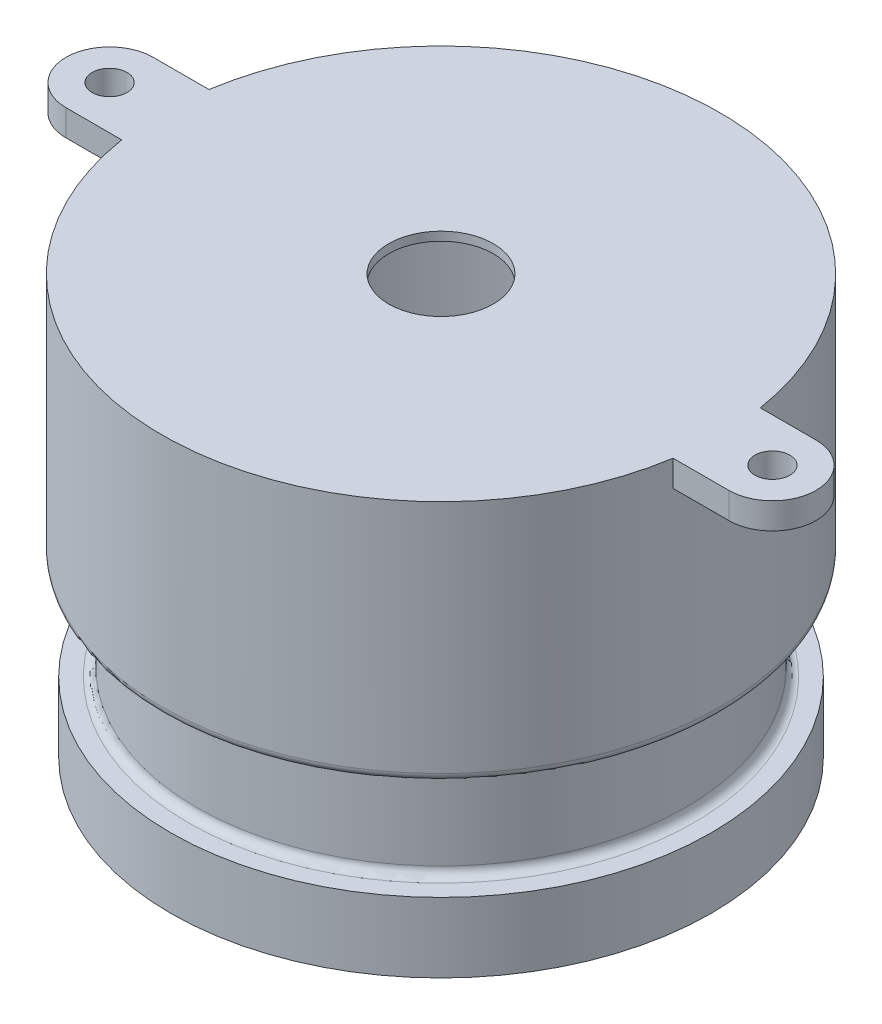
ISO-10303-21;
HEADER;
FILE_DESCRIPTION(('STEP AP214'),'2;1');
FILE_NAME('part.step','',(''),(''),'','','');
FILE_SCHEMA(('AUTOMOTIVE_DESIGN { 1 0 10303 214 1 1 1 1 }'));
ENDSEC;
DATA;
#1=APPLICATION_CONTEXT('core data for automotive mechanical design processes');
#2=APPLICATION_PROTOCOL_DEFINITION('international standard','automotive_design',2000,#1);
#3=PRODUCT_CONTEXT('',#1,'mechanical');
#4=PRODUCT('Part','Part','',(#3));
#5=PRODUCT_RELATED_PRODUCT_CATEGORY('part','',(#4));
#6=PRODUCT_DEFINITION_FORMATION('','',#4);
#7=PRODUCT_DEFINITION_CONTEXT('part definition',#1,'design');
#8=PRODUCT_DEFINITION('design','',#6,#7);
#9=PRODUCT_DEFINITION_SHAPE('','',#8);
#10=(LENGTH_UNIT() NAMED_UNIT(*) SI_UNIT(.MILLI.,.METRE.));
#11=(NAMED_UNIT(*) PLANE_ANGLE_UNIT() SI_UNIT($,.RADIAN.));
#12=(NAMED_UNIT(*) SI_UNIT($,.STERADIAN.) SOLID_ANGLE_UNIT());
#13=UNCERTAINTY_MEASURE_WITH_UNIT(LENGTH_MEASURE(1.E-05),#10,'distance_accuracy_value','');
#14=(GEOMETRIC_REPRESENTATION_CONTEXT(3) GLOBAL_UNCERTAINTY_ASSIGNED_CONTEXT((#13)) GLOBAL_UNIT_ASSIGNED_CONTEXT((#10,
#11,#12)) REPRESENTATION_CONTEXT('',''));
#15=CARTESIAN_POINT('',(0.,0.,0.));
#16=DIRECTION('',(0.,0.,1.));
#17=DIRECTION('',(1.,0.,0.));
#18=AXIS2_PLACEMENT_3D('',#15,#16,#17);
#19=CARTESIAN_POINT('',(-49.2125,-76.2,0.));
#20=DIRECTION('',(0.,1.,0.));
#21=DIRECTION('',(0.,0.,1.));
#22=AXIS2_PLACEMENT_3D('',#19,#20,#21);
#23=PLANE('',#22);
#24=CARTESIAN_POINT('',(0.,-76.2,0.));
#25=DIRECTION('',(0.,-1.,0.));
#26=DIRECTION('',(0.,0.,-1.));
#27=AXIS2_PLACEMENT_3D('',#24,#25,#26);
#28=CIRCLE('',#27,49.2125);
#29=CARTESIAN_POINT('',(0.,-76.2,-49.2125));
#30=VERTEX_POINT('',#29);
#31=EDGE_CURVE('E197',#30,#30,#28,.T.);
#32=ORIENTED_EDGE('',*,*,#31,.T.);
#33=EDGE_LOOP('',(#32));
#34=FACE_BOUND('',#33,.T.);
#35=CARTESIAN_POINT('',(0.,-76.2,0.));
#36=DIRECTION('',(0.,1.,0.));
#37=DIRECTION('',(0.,0.,1.));
#38=AXIS2_PLACEMENT_3D('',#35,#36,#37);
#39=CIRCLE('',#38,47.625);
#40=CARTESIAN_POINT('',(0.,-76.2,47.625));
#41=VERTEX_POINT('',#40);
#42=EDGE_CURVE('E185',#41,#41,#39,.F.);
#43=ORIENTED_EDGE('',*,*,#42,.F.);
#44=EDGE_LOOP('',(#43));
#45=FACE_BOUND('',#44,.T.);
#46=ADVANCED_FACE('F29',(#34,#45),#23,.F.);
#47=CARTESIAN_POINT('',(0.,0.,0.));
#48=DIRECTION('',(0.,-1.,0.));
#49=DIRECTION('',(0.,0.,-1.));
#50=AXIS2_PLACEMENT_3D('',#47,#48,#49);
#51=CYLINDRICAL_SURFACE('',#50,49.2125);
#52=ORIENTED_EDGE('',*,*,#31,.F.);
#53=EDGE_LOOP('',(#52));
#54=FACE_BOUND('',#53,.T.);
#55=CARTESIAN_POINT('',(0.,-63.5,0.));
#56=DIRECTION('',(0.,-1.,0.));
#57=DIRECTION('',(0.,0.,-1.));
#58=AXIS2_PLACEMENT_3D('',#55,#56,#57);
#59=CIRCLE('',#58,49.2125);
#60=CARTESIAN_POINT('',(0.,-63.5,-49.2125));
#61=VERTEX_POINT('',#60);
#62=EDGE_CURVE('E194',#61,#61,#59,.T.);
#63=ORIENTED_EDGE('',*,*,#62,.T.);
#64=EDGE_LOOP('',(#63));
#65=FACE_BOUND('',#64,.T.);
#66=ADVANCED_FACE('F243',(#54,#65),#51,.T.);
#67=CARTESIAN_POINT('',(-44.45,-63.5,0.));
#68=DIRECTION('',(0.,-1.,0.));
#69=DIRECTION('',(0.,0.,-1.));
#70=AXIS2_PLACEMENT_3D('',#67,#68,#69);
#71=PLANE('',#70);
#72=CARTESIAN_POINT('',(0.,-63.5,0.));
#73=DIRECTION('',(0.,-1.,0.));
#74=DIRECTION('',(0.,0.,-1.));
#75=AXIS2_PLACEMENT_3D('',#72,#73,#74);
#76=CIRCLE('',#75,46.0375);
#77=CARTESIAN_POINT('',(0.,-63.5,-46.0375));
#78=VERTEX_POINT('',#77);
#79=EDGE_CURVE('E215',#78,#78,#76,.T.);
#80=ORIENTED_EDGE('',*,*,#79,.T.);
#81=EDGE_LOOP('',(#80));
#82=FACE_BOUND('',#81,.T.);
#83=ORIENTED_EDGE('',*,*,#62,.F.);
#84=EDGE_LOOP('',(#83));
#85=FACE_BOUND('',#84,.T.);
#86=ADVANCED_FACE('F250',(#82,#85),#71,.F.);
#87=CARTESIAN_POINT('',(0.,0.,0.));
#88=DIRECTION('',(0.,-1.,0.));
#89=DIRECTION('',(0.,0.,-1.));
#90=AXIS2_PLACEMENT_3D('',#87,#88,#89);
#91=CYLINDRICAL_SURFACE('',#90,44.45);
#92=CARTESIAN_POINT('',(0.,-46.0375,0.));
#93=DIRECTION('',(0.,1.,0.));
#94=DIRECTION('',(0.,0.,1.));
#95=AXIS2_PLACEMENT_3D('',#92,#93,#94);
#96=CIRCLE('',#95,44.45);
#97=CARTESIAN_POINT('',(0.,-46.0375,44.45));
#98=VERTEX_POINT('',#97);
#99=EDGE_CURVE('E212',#98,#98,#96,.F.);
#100=ORIENTED_EDGE('',*,*,#99,.T.);
#101=EDGE_LOOP('',(#100));
#102=FACE_BOUND('',#101,.T.);
#103=CARTESIAN_POINT('',(0.,-61.9125,0.));
#104=DIRECTION('',(0.,-1.,0.));
#105=DIRECTION('',(0.,0.,-1.));
#106=AXIS2_PLACEMENT_3D('',#103,#104,#105);
#107=CIRCLE('',#106,44.45);
#108=CARTESIAN_POINT('',(0.,-61.9125,-44.45));
#109=VERTEX_POINT('',#108);
#110=EDGE_CURVE('E209',#109,#109,#107,.F.);
#111=ORIENTED_EDGE('',*,*,#110,.T.);
#112=EDGE_LOOP('',(#111));
#113=FACE_BOUND('',#112,.T.);
#114=ADVANCED_FACE('F310',(#102,#113),#91,.T.);
#115=CARTESIAN_POINT('',(-50.8,-44.45,0.));
#116=DIRECTION('',(0.,1.,0.));
#117=DIRECTION('',(0.,0.,1.));
#118=AXIS2_PLACEMENT_3D('',#115,#116,#117);
#119=PLANE('',#118);
#120=CARTESIAN_POINT('',(0.,-44.45,0.));
#121=DIRECTION('',(0.,1.,0.));
#122=DIRECTION('',(0.,0.,1.));
#123=AXIS2_PLACEMENT_3D('',#120,#121,#122);
#124=CIRCLE('',#123,49.2125);
#125=CARTESIAN_POINT('',(0.,-44.45,49.2125));
#126=VERTEX_POINT('',#125);
#127=EDGE_CURVE('E203',#126,#126,#124,.F.);
#128=ORIENTED_EDGE('',*,*,#127,.T.);
#129=EDGE_LOOP('',(#128));
#130=FACE_BOUND('',#129,.T.);
#131=CARTESIAN_POINT('',(0.,-44.45,0.));
#132=DIRECTION('',(0.,1.,0.));
#133=DIRECTION('',(0.,0.,1.));
#134=AXIS2_PLACEMENT_3D('',#131,#132,#133);
#135=CIRCLE('',#134,46.0375);
#136=CARTESIAN_POINT('',(0.,-44.45,46.0375));
#137=VERTEX_POINT('',#136);
#138=EDGE_CURVE('E200',#137,#137,#135,.T.);
#139=ORIENTED_EDGE('',*,*,#138,.T.);
#140=EDGE_LOOP('',(#139));
#141=FACE_BOUND('',#140,.T.);
#142=ADVANCED_FACE('F307',(#130,#141),#119,.F.);
#143=CARTESIAN_POINT('',(0.,0.,0.));
#144=DIRECTION('',(0.,-1.,0.));
#145=DIRECTION('',(0.,0.,-1.));
#146=AXIS2_PLACEMENT_3D('',#143,#144,#145);
#147=CYLINDRICAL_SURFACE('',#146,50.8);
#148=CARTESIAN_POINT('',(0.,-4.7625,0.));
#149=DIRECTION('',(0.,-1.,0.));
#150=DIRECTION('',(0.,0.,-1.));
#151=AXIS2_PLACEMENT_3D('',#148,#149,#150);
#152=CIRCLE('',#151,50.8);
#153=CARTESIAN_POINT('',(50.1760509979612,-4.7625,-7.93750000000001));
#154=VERTEX_POINT('',#153);
#155=CARTESIAN_POINT('',(50.1760509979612,-4.7625,7.93749999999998));
#156=VERTEX_POINT('',#155);
#157=EDGE_CURVE('E44',#154,#156,#152,.T.);
#158=ORIENTED_EDGE('',*,*,#157,.T.);
#159=DIRECTION('',(0.,1.,0.));
#160=VECTOR('',#159,1.);
#161=CARTESIAN_POINT('',(50.1760509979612,-4.7625,7.93749999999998));
#162=LINE('',#161,#160);
#163=CARTESIAN_POINT('',(50.1760509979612,0.,7.93749999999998));
#164=VERTEX_POINT('',#163);
#165=EDGE_CURVE('E132',#156,#164,#162,.T.);
#166=ORIENTED_EDGE('',*,*,#165,.T.);
#167=CARTESIAN_POINT('',(0.,0.,0.));
#168=DIRECTION('',(0.,-1.,0.));
#169=DIRECTION('',(0.,0.,-1.));
#170=AXIS2_PLACEMENT_3D('',#167,#168,#169);
#171=CIRCLE('',#170,50.8);
#172=CARTESIAN_POINT('',(-50.1760509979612,0.,7.9375));
#173=VERTEX_POINT('',#172);
#174=EDGE_CURVE('E174',#164,#173,#171,.T.);
#175=ORIENTED_EDGE('',*,*,#174,.T.);
#176=DIRECTION('',(0.,1.,0.));
#177=VECTOR('',#176,1.);
#178=CARTESIAN_POINT('',(-50.1760509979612,-4.7625,7.9375));
#179=LINE('',#178,#177);
#180=CARTESIAN_POINT('',(-50.1760509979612,-4.7625,7.9375));
#181=VERTEX_POINT('',#180);
#182=EDGE_CURVE('E161',#181,#173,#179,.T.);
#183=ORIENTED_EDGE('',*,*,#182,.F.);
#184=CARTESIAN_POINT('',(0.,-4.7625,0.));
#185=DIRECTION('',(0.,-1.,0.));
#186=DIRECTION('',(0.,0.,1.));
#187=AXIS2_PLACEMENT_3D('',#184,#185,#186);
#188=CIRCLE('',#187,50.8);
#189=CARTESIAN_POINT('',(-50.1760509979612,-4.7625,-7.9375));
#190=VERTEX_POINT('',#189);
#191=EDGE_CURVE('E149',#181,#190,#188,.T.);
#192=ORIENTED_EDGE('',*,*,#191,.T.);
#193=DIRECTION('',(0.,1.,0.));
#194=VECTOR('',#193,1.);
#195=CARTESIAN_POINT('',(-50.1760509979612,-4.7625,-7.9375));
#196=LINE('',#195,#194);
#197=CARTESIAN_POINT('',(-50.1760509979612,0.,-7.9375));
#198=VERTEX_POINT('',#197);
#199=EDGE_CURVE('E160',#190,#198,#196,.T.);
#200=ORIENTED_EDGE('',*,*,#199,.T.);
#201=CARTESIAN_POINT('',(50.1760509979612,0.,-7.93750000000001));
#202=VERTEX_POINT('',#201);
#203=EDGE_CURVE('E192',#198,#202,#171,.T.);
#204=ORIENTED_EDGE('',*,*,#203,.T.);
#205=DIRECTION('',(0.,1.,0.));
#206=VECTOR('',#205,1.);
#207=CARTESIAN_POINT('',(50.1760509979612,-4.7625,-7.93750000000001));
#208=LINE('',#207,#206);
#209=EDGE_CURVE('E49',#154,#202,#208,.T.);
#210=ORIENTED_EDGE('',*,*,#209,.F.);
#211=EDGE_LOOP('',(#158,#166,#175,#183,#192,#200,#204,#210));
#212=FACE_BOUND('',#211,.T.);
#213=CARTESIAN_POINT('',(0.,-42.8625,0.));
#214=DIRECTION('',(0.,1.,0.));
#215=DIRECTION('',(0.,0.,1.));
#216=AXIS2_PLACEMENT_3D('',#213,#214,#215);
#217=CIRCLE('',#216,50.8);
#218=CARTESIAN_POINT('',(0.,-42.8625,50.8));
#219=VERTEX_POINT('',#218);
#220=EDGE_CURVE('E206',#219,#219,#217,.T.);
#221=ORIENTED_EDGE('',*,*,#220,.T.);
#222=EDGE_LOOP('',(#221));
#223=FACE_BOUND('',#222,.T.);
#224=ADVANCED_FACE('F303',(#212,#223),#147,.T.);
#225=CARTESIAN_POINT('',(0.,0.,0.));
#226=DIRECTION('',(0.,-1.,0.));
#227=DIRECTION('',(0.,0.,-1.));
#228=AXIS2_PLACEMENT_3D('',#225,#226,#227);
#229=PLANE('',#228);
#230=CARTESIAN_POINT('',(0.,0.,0.));
#231=DIRECTION('',(0.,1.,0.));
#232=DIRECTION('',(0.,0.,1.));
#233=AXIS2_PLACEMENT_3D('',#230,#231,#232);
#234=CIRCLE('',#233,9.525);
#235=CARTESIAN_POINT('',(0.,0.,9.525));
#236=VERTEX_POINT('',#235);
#237=EDGE_CURVE('E488',#236,#236,#234,.T.);
#238=ORIENTED_EDGE('',*,*,#237,.F.);
#239=EDGE_LOOP('',(#238));
#240=FACE_BOUND('',#239,.T.);
#241=ORIENTED_EDGE('',*,*,#203,.F.);
#242=DIRECTION('',(-1.,0.,0.));
#243=VECTOR('',#242,1.);
#244=CARTESIAN_POINT('',(-50.1760509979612,0.,-7.9375));
#245=LINE('',#244,#243);
#246=CARTESIAN_POINT('',(-60.325,0.,-7.93750000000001));
#247=VERTEX_POINT('',#246);
#248=EDGE_CURVE('E140',#198,#247,#245,.T.);
#249=ORIENTED_EDGE('',*,*,#248,.T.);
#250=CARTESIAN_POINT('',(-60.325,0.,0.));
#251=DIRECTION('',(0.,1.,0.));
#252=DIRECTION('',(0.,0.,1.));
#253=AXIS2_PLACEMENT_3D('',#250,#251,#252);
#254=CIRCLE('',#253,7.93750000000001);
#255=CARTESIAN_POINT('',(-60.325,0.,7.93750000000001));
#256=VERTEX_POINT('',#255);
#257=EDGE_CURVE('E143',#247,#256,#254,.T.);
#258=ORIENTED_EDGE('',*,*,#257,.T.);
#259=DIRECTION('',(1.,0.,0.));
#260=VECTOR('',#259,1.);
#261=CARTESIAN_POINT('',(-60.325,0.,7.93750000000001));
#262=LINE('',#261,#260);
#263=EDGE_CURVE('E146',#256,#173,#262,.T.);
#264=ORIENTED_EDGE('',*,*,#263,.T.);
#265=ORIENTED_EDGE('',*,*,#174,.F.);
#266=DIRECTION('',(1.,0.,0.));
#267=VECTOR('',#266,1.);
#268=CARTESIAN_POINT('',(60.325,0.,7.93749999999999));
#269=LINE('',#268,#267);
#270=CARTESIAN_POINT('',(60.325,0.,7.93749999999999));
#271=VERTEX_POINT('',#270);
#272=EDGE_CURVE('E110',#164,#271,#269,.T.);
#273=ORIENTED_EDGE('',*,*,#272,.T.);
#274=CARTESIAN_POINT('',(60.325,0.,0.));
#275=DIRECTION('',(0.,1.,0.));
#276=DIRECTION('',(0.,0.,-1.));
#277=AXIS2_PLACEMENT_3D('',#274,#275,#276);
#278=CIRCLE('',#277,7.93750000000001);
#279=CARTESIAN_POINT('',(60.325,0.,-7.93750000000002));
#280=VERTEX_POINT('',#279);
#281=EDGE_CURVE('E97',#271,#280,#278,.T.);
#282=ORIENTED_EDGE('',*,*,#281,.T.);
#283=DIRECTION('',(-1.,0.,0.));
#284=VECTOR('',#283,1.);
#285=CARTESIAN_POINT('',(50.1760509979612,0.,-7.93750000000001));
#286=LINE('',#285,#284);
#287=EDGE_CURVE('E107',#280,#202,#286,.T.);
#288=ORIENTED_EDGE('',*,*,#287,.T.);
#289=EDGE_LOOP('',(#241,#249,#258,#264,#265,#273,#282,#288));
#290=FACE_BOUND('',#289,.T.);
#291=CARTESIAN_POINT('',(-60.325,0.,0.));
#292=DIRECTION('',(0.,1.,0.));
#293=DIRECTION('',(0.,0.,1.));
#294=AXIS2_PLACEMENT_3D('',#291,#292,#293);
#295=CIRCLE('',#294,3.175);
#296=CARTESIAN_POINT('',(-60.325,0.,3.175));
#297=VERTEX_POINT('',#296);
#298=EDGE_CURVE('E131',#297,#297,#295,.T.);
#299=ORIENTED_EDGE('',*,*,#298,.F.);
#300=EDGE_LOOP('',(#299));
#301=FACE_BOUND('',#300,.T.);
#302=CARTESIAN_POINT('',(60.325,0.,0.));
#303=DIRECTION('',(0.,1.,0.));
#304=DIRECTION('',(0.,0.,-1.));
#305=AXIS2_PLACEMENT_3D('',#302,#303,#304);
#306=CIRCLE('',#305,3.175);
#307=CARTESIAN_POINT('',(60.325,0.,3.17499999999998));
#308=VERTEX_POINT('',#307);
#309=EDGE_CURVE('E118',#308,#308,#306,.T.);
#310=ORIENTED_EDGE('',*,*,#309,.F.);
#311=EDGE_LOOP('',(#310));
#312=FACE_BOUND('',#311,.T.);
#313=ADVANCED_FACE('F112',(#240,#290,#301,#312),#229,.F.);
#314=CARTESIAN_POINT('',(0.,-42.8625,0.));
#315=DIRECTION('',(0.,1.,0.));
#316=DIRECTION('',(0.,0.,1.));
#317=AXIS2_PLACEMENT_3D('',#314,#315,#316);
#318=TOROIDAL_SURFACE('',#317,49.2125,1.5875);
#319=ORIENTED_EDGE('',*,*,#220,.F.);
#320=EDGE_LOOP('',(#319));
#321=FACE_BOUND('',#320,.T.);
#322=ORIENTED_EDGE('',*,*,#127,.F.);
#323=EDGE_LOOP('',(#322));
#324=FACE_BOUND('',#323,.T.);
#325=ADVANCED_FACE('F297',(#321,#324),#318,.T.);
#326=CARTESIAN_POINT('',(0.,-46.0375,0.));
#327=DIRECTION('',(0.,1.,0.));
#328=DIRECTION('',(0.,0.,1.));
#329=AXIS2_PLACEMENT_3D('',#326,#327,#328);
#330=TOROIDAL_SURFACE('',#329,46.0375,1.5875);
#331=ORIENTED_EDGE('',*,*,#138,.F.);
#332=EDGE_LOOP('',(#331));
#333=FACE_BOUND('',#332,.T.);
#334=ORIENTED_EDGE('',*,*,#99,.F.);
#335=EDGE_LOOP('',(#334));
#336=FACE_BOUND('',#335,.T.);
#337=ADVANCED_FACE('F265',(#333,#336),#330,.F.);
#338=CARTESIAN_POINT('',(0.,-61.9125,0.));
#339=DIRECTION('',(0.,-1.,0.));
#340=DIRECTION('',(0.,0.,-1.));
#341=AXIS2_PLACEMENT_3D('',#338,#339,#340);
#342=TOROIDAL_SURFACE('',#341,46.0375,1.5875);
#343=ORIENTED_EDGE('',*,*,#110,.F.);
#344=EDGE_LOOP('',(#343));
#345=FACE_BOUND('',#344,.T.);
#346=ORIENTED_EDGE('',*,*,#79,.F.);
#347=EDGE_LOOP('',(#346));
#348=FACE_BOUND('',#347,.T.);
#349=ADVANCED_FACE('F258',(#345,#348),#342,.F.);
#350=CARTESIAN_POINT('',(0.,0.,0.));
#351=DIRECTION('',(0.,-1.,0.));
#352=DIRECTION('',(0.,0.,-1.));
#353=AXIS2_PLACEMENT_3D('',#350,#351,#352);
#354=CYLINDRICAL_SURFACE('',#353,47.625);
#355=CARTESIAN_POINT('',(0.,-65.88125,0.));
#356=DIRECTION('',(0.,-1.,0.));
#357=DIRECTION('',(0.,0.,-1.));
#358=AXIS2_PLACEMENT_3D('',#355,#356,#357);
#359=CIRCLE('',#358,47.625);
#360=CARTESIAN_POINT('',(0.,-65.88125,-47.625));
#361=VERTEX_POINT('',#360);
#362=EDGE_CURVE('E11',#361,#361,#359,.F.);
#363=ORIENTED_EDGE('',*,*,#362,.T.);
#364=EDGE_LOOP('',(#363));
#365=FACE_BOUND('',#364,.T.);
#366=ORIENTED_EDGE('',*,*,#42,.T.);
#367=EDGE_LOOP('',(#366));
#368=FACE_BOUND('',#367,.T.);
#369=ADVANCED_FACE('F256',(#365,#368),#354,.F.);
#370=CARTESIAN_POINT('',(-44.45,-65.0875,0.));
#371=DIRECTION('',(0.,-1.,0.));
#372=DIRECTION('',(0.,0.,-1.));
#373=AXIS2_PLACEMENT_3D('',#370,#371,#372);
#374=PLANE('',#373);
#375=CARTESIAN_POINT('',(0.,-65.0875,0.));
#376=DIRECTION('',(0.,-1.,0.));
#377=DIRECTION('',(0.,0.,-1.));
#378=AXIS2_PLACEMENT_3D('',#375,#376,#377);
#379=CIRCLE('',#378,46.83125);
#380=CARTESIAN_POINT('',(0.,-65.0875,-46.83125));
#381=VERTEX_POINT('',#380);
#382=EDGE_CURVE('E37',#381,#381,#379,.T.);
#383=ORIENTED_EDGE('',*,*,#382,.T.);
#384=EDGE_LOOP('',(#383));
#385=FACE_BOUND('',#384,.T.);
#386=CARTESIAN_POINT('',(0.,-65.0875,0.));
#387=DIRECTION('',(0.,-1.,0.));
#388=DIRECTION('',(0.,0.,-1.));
#389=AXIS2_PLACEMENT_3D('',#386,#387,#388);
#390=CIRCLE('',#389,46.0375);
#391=CARTESIAN_POINT('',(0.,-65.0875,-46.0375));
#392=VERTEX_POINT('',#391);
#393=EDGE_CURVE('E171',#392,#392,#390,.T.);
#394=ORIENTED_EDGE('',*,*,#393,.F.);
#395=EDGE_LOOP('',(#394));
#396=FACE_BOUND('',#395,.T.);
#397=ADVANCED_FACE('F221',(#385,#396),#374,.T.);
#398=CARTESIAN_POINT('',(0.,0.,0.));
#399=DIRECTION('',(0.,-1.,0.));
#400=DIRECTION('',(0.,0.,-1.));
#401=AXIS2_PLACEMENT_3D('',#398,#399,#400);
#402=CYLINDRICAL_SURFACE('',#401,42.8625);
#403=CARTESIAN_POINT('',(0.,-46.0375,0.));
#404=DIRECTION('',(0.,-1.,0.));
#405=DIRECTION('',(0.,0.,-1.));
#406=AXIS2_PLACEMENT_3D('',#403,#404,#405);
#407=CIRCLE('',#406,42.8625);
#408=CARTESIAN_POINT('',(0.,-46.0375,-42.8625));
#409=VERTEX_POINT('',#408);
#410=EDGE_CURVE('E175',#409,#409,#407,.T.);
#411=ORIENTED_EDGE('',*,*,#410,.F.);
#412=EDGE_LOOP('',(#411));
#413=FACE_BOUND('',#412,.T.);
#414=CARTESIAN_POINT('',(0.,-61.9125,0.));
#415=DIRECTION('',(0.,-1.,0.));
#416=DIRECTION('',(0.,0.,-1.));
#417=AXIS2_PLACEMENT_3D('',#414,#415,#416);
#418=CIRCLE('',#417,42.8625);
#419=CARTESIAN_POINT('',(0.,-61.9125,-42.8625));
#420=VERTEX_POINT('',#419);
#421=EDGE_CURVE('E176',#420,#420,#418,.F.);
#422=ORIENTED_EDGE('',*,*,#421,.F.);
#423=EDGE_LOOP('',(#422));
#424=FACE_BOUND('',#423,.T.);
#425=ADVANCED_FACE('F263',(#413,#424),#402,.F.);
#426=CARTESIAN_POINT('',(-50.8,-42.8625,0.));
#427=DIRECTION('',(0.,1.,0.));
#428=DIRECTION('',(0.,0.,1.));
#429=AXIS2_PLACEMENT_3D('',#426,#427,#428);
#430=PLANE('',#429);
#431=CARTESIAN_POINT('',(0.,-42.8625,0.));
#432=DIRECTION('',(0.,1.,0.));
#433=DIRECTION('',(0.,0.,1.));
#434=AXIS2_PLACEMENT_3D('',#431,#432,#433);
#435=CIRCLE('',#434,49.2125);
#436=CARTESIAN_POINT('',(0.,-42.8625,49.2125));
#437=VERTEX_POINT('',#436);
#438=EDGE_CURVE('E179',#437,#437,#435,.F.);
#439=ORIENTED_EDGE('',*,*,#438,.F.);
#440=EDGE_LOOP('',(#439));
#441=FACE_BOUND('',#440,.T.);
#442=CARTESIAN_POINT('',(0.,-42.8625,0.));
#443=DIRECTION('',(0.,1.,0.));
#444=DIRECTION('',(0.,0.,1.));
#445=AXIS2_PLACEMENT_3D('',#442,#443,#444);
#446=CIRCLE('',#445,46.0375);
#447=CARTESIAN_POINT('',(0.,-42.8625,46.0375));
#448=VERTEX_POINT('',#447);
#449=EDGE_CURVE('E182',#448,#448,#446,.T.);
#450=ORIENTED_EDGE('',*,*,#449,.F.);
#451=EDGE_LOOP('',(#450));
#452=FACE_BOUND('',#451,.T.);
#453=ADVANCED_FACE('F273',(#441,#452),#430,.T.);
#454=CARTESIAN_POINT('',(0.,0.,0.));
#455=DIRECTION('',(0.,-1.,0.));
#456=DIRECTION('',(0.,0.,-1.));
#457=AXIS2_PLACEMENT_3D('',#454,#455,#456);
#458=CYLINDRICAL_SURFACE('',#457,49.2125);
#459=ORIENTED_EDGE('',*,*,#438,.T.);
#460=EDGE_LOOP('',(#459));
#461=FACE_BOUND('',#460,.T.);
#462=CARTESIAN_POINT('',(0.,-1.5875,0.));
#463=DIRECTION('',(0.,-1.,0.));
#464=DIRECTION('',(0.,0.,-1.));
#465=AXIS2_PLACEMENT_3D('',#462,#463,#464);
#466=CIRCLE('',#465,49.2125);
#467=CARTESIAN_POINT('',(0.,-1.5875,-49.2125));
#468=VERTEX_POINT('',#467);
#469=EDGE_CURVE('E164',#468,#468,#466,.T.);
#470=ORIENTED_EDGE('',*,*,#469,.F.);
#471=EDGE_LOOP('',(#470));
#472=FACE_BOUND('',#471,.T.);
#473=ADVANCED_FACE('F277',(#461,#472),#458,.F.);
#474=CARTESIAN_POINT('',(0.,-1.5875,0.));
#475=DIRECTION('',(0.,-1.,0.));
#476=DIRECTION('',(0.,0.,-1.));
#477=AXIS2_PLACEMENT_3D('',#474,#475,#476);
#478=PLANE('',#477);
#479=CARTESIAN_POINT('',(0.,-1.58750000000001,0.));
#480=DIRECTION('',(0.,-1.,0.));
#481=DIRECTION('',(0.,0.,-1.));
#482=AXIS2_PLACEMENT_3D('',#479,#480,#481);
#483=CIRCLE('',#482,9.525);
#484=CARTESIAN_POINT('',(0.,-1.58750000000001,-9.525));
#485=VERTEX_POINT('',#484);
#486=EDGE_CURVE('E32',#485,#485,#483,.T.);
#487=ORIENTED_EDGE('',*,*,#486,.F.);
#488=EDGE_LOOP('',(#487));
#489=FACE_BOUND('',#488,.T.);
#490=ORIENTED_EDGE('',*,*,#469,.T.);
#491=EDGE_LOOP('',(#490));
#492=FACE_BOUND('',#491,.T.);
#493=ADVANCED_FACE('F281',(#489,#492),#478,.T.);
#494=CARTESIAN_POINT('',(0.,-46.0375,0.));
#495=DIRECTION('',(0.,1.,0.));
#496=DIRECTION('',(0.,0.,1.));
#497=AXIS2_PLACEMENT_3D('',#494,#495,#496);
#498=TOROIDAL_SURFACE('',#497,46.0375,3.175);
#499=ORIENTED_EDGE('',*,*,#449,.T.);
#500=EDGE_LOOP('',(#499));
#501=FACE_BOUND('',#500,.T.);
#502=ORIENTED_EDGE('',*,*,#410,.T.);
#503=EDGE_LOOP('',(#502));
#504=FACE_BOUND('',#503,.T.);
#505=ADVANCED_FACE('F285',(#501,#504),#498,.T.);
#506=CARTESIAN_POINT('',(0.,-61.9125,0.));
#507=DIRECTION('',(0.,-1.,0.));
#508=DIRECTION('',(0.,0.,-1.));
#509=AXIS2_PLACEMENT_3D('',#506,#507,#508);
#510=TOROIDAL_SURFACE('',#509,46.0375,3.175);
#511=ORIENTED_EDGE('',*,*,#421,.T.);
#512=EDGE_LOOP('',(#511));
#513=FACE_BOUND('',#512,.T.);
#514=ORIENTED_EDGE('',*,*,#393,.T.);
#515=EDGE_LOOP('',(#514));
#516=FACE_BOUND('',#515,.T.);
#517=ADVANCED_FACE('F289',(#513,#516),#510,.T.);
#518=CARTESIAN_POINT('',(-60.325,-4.7625,7.93750000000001));
#519=DIRECTION('',(0.,0.,1.));
#520=DIRECTION('',(1.,0.,0.));
#521=AXIS2_PLACEMENT_3D('',#518,#519,#520);
#522=PLANE('',#521);
#523=ORIENTED_EDGE('',*,*,#263,.F.);
#524=DIRECTION('',(0.,1.,0.));
#525=VECTOR('',#524,1.);
#526=CARTESIAN_POINT('',(-60.325,-4.7625,7.93750000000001));
#527=LINE('',#526,#525);
#528=CARTESIAN_POINT('',(-60.325,-4.7625,7.93750000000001));
#529=VERTEX_POINT('',#528);
#530=EDGE_CURVE('E165',#529,#256,#527,.T.);
#531=ORIENTED_EDGE('',*,*,#530,.F.);
#532=DIRECTION('',(1.,0.,0.));
#533=VECTOR('',#532,1.);
#534=CARTESIAN_POINT('',(-60.325,-4.7625,7.93750000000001));
#535=LINE('',#534,#533);
#536=EDGE_CURVE('E157',#529,#181,#535,.T.);
#537=ORIENTED_EDGE('',*,*,#536,.T.);
#538=ORIENTED_EDGE('',*,*,#182,.T.);
#539=EDGE_LOOP('',(#523,#531,#537,#538));
#540=FACE_BOUND('',#539,.T.);
#541=ADVANCED_FACE('F292',(#540),#522,.T.);
#542=CARTESIAN_POINT('',(-60.325,-4.7625,0.));
#543=DIRECTION('',(0.,1.,0.));
#544=DIRECTION('',(0.,0.,1.));
#545=AXIS2_PLACEMENT_3D('',#542,#543,#544);
#546=CYLINDRICAL_SURFACE('',#545,7.93750000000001);
#547=ORIENTED_EDGE('',*,*,#257,.F.);
#548=DIRECTION('',(0.,1.,0.));
#549=VECTOR('',#548,1.);
#550=CARTESIAN_POINT('',(-60.325,-4.7625,-7.93750000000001));
#551=LINE('',#550,#549);
#552=CARTESIAN_POINT('',(-60.325,-4.7625,-7.93750000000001));
#553=VERTEX_POINT('',#552);
#554=EDGE_CURVE('E167',#553,#247,#551,.T.);
#555=ORIENTED_EDGE('',*,*,#554,.F.);
#556=CARTESIAN_POINT('',(-60.325,-4.7625,0.));
#557=DIRECTION('',(0.,1.,0.));
#558=DIRECTION('',(0.,0.,1.));
#559=AXIS2_PLACEMENT_3D('',#556,#557,#558);
#560=CIRCLE('',#559,7.93750000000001);
#561=EDGE_CURVE('E154',#553,#529,#560,.T.);
#562=ORIENTED_EDGE('',*,*,#561,.T.);
#563=ORIENTED_EDGE('',*,*,#530,.T.);
#564=EDGE_LOOP('',(#547,#555,#562,#563));
#565=FACE_BOUND('',#564,.T.);
#566=ADVANCED_FACE('F393',(#565),#546,.T.);
#567=CARTESIAN_POINT('',(-50.1760509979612,-4.7625,-7.9375));
#568=DIRECTION('',(0.,0.,-1.));
#569=DIRECTION('',(-1.,0.,0.));
#570=AXIS2_PLACEMENT_3D('',#567,#568,#569);
#571=PLANE('',#570);
#572=ORIENTED_EDGE('',*,*,#248,.F.);
#573=ORIENTED_EDGE('',*,*,#199,.F.);
#574=DIRECTION('',(-1.,0.,0.));
#575=VECTOR('',#574,1.);
#576=CARTESIAN_POINT('',(-50.1760509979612,-4.7625,-7.9375));
#577=LINE('',#576,#575);
#578=EDGE_CURVE('E151',#190,#553,#577,.T.);
#579=ORIENTED_EDGE('',*,*,#578,.T.);
#580=ORIENTED_EDGE('',*,*,#554,.T.);
#581=EDGE_LOOP('',(#572,#573,#579,#580));
#582=FACE_BOUND('',#581,.T.);
#583=ADVANCED_FACE('F269',(#582),#571,.T.);
#584=CARTESIAN_POINT('',(0.,-4.7625,0.));
#585=DIRECTION('',(0.,1.,0.));
#586=DIRECTION('',(0.,0.,1.));
#587=AXIS2_PLACEMENT_3D('',#584,#585,#586);
#588=PLANE('',#587);
#589=CARTESIAN_POINT('',(-60.325,-4.7625,0.));
#590=DIRECTION('',(0.,1.,0.));
#591=DIRECTION('',(0.,0.,1.));
#592=AXIS2_PLACEMENT_3D('',#589,#590,#591);
#593=CIRCLE('',#592,3.175);
#594=CARTESIAN_POINT('',(-60.325,-4.7625,3.175));
#595=VERTEX_POINT('',#594);
#596=EDGE_CURVE('E137',#595,#595,#593,.T.);
#597=ORIENTED_EDGE('',*,*,#596,.T.);
#598=EDGE_LOOP('',(#597));
#599=FACE_BOUND('',#598,.T.);
#600=ORIENTED_EDGE('',*,*,#191,.F.);
#601=ORIENTED_EDGE('',*,*,#536,.F.);
#602=ORIENTED_EDGE('',*,*,#561,.F.);
#603=ORIENTED_EDGE('',*,*,#578,.F.);
#604=EDGE_LOOP('',(#600,#601,#602,#603));
#605=FACE_BOUND('',#604,.T.);
#606=ADVANCED_FACE('F407',(#599,#605),#588,.F.);
#607=CARTESIAN_POINT('',(-60.325,-4.7625,0.));
#608=DIRECTION('',(0.,1.,0.));
#609=DIRECTION('',(0.,0.,1.));
#610=AXIS2_PLACEMENT_3D('',#607,#608,#609);
#611=CYLINDRICAL_SURFACE('',#610,3.175);
#612=CARTESIAN_POINT('',(-60.325,-4.7625,3.175));
#613=CARTESIAN_POINT('',(-60.325,-4.712890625,3.175));
#614=CARTESIAN_POINT('',(-60.325,-4.66328125,3.175));
#615=CARTESIAN_POINT('',(-60.325,-4.5640625,3.175));
#616=CARTESIAN_POINT('',(-60.325,-4.514453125,3.175));
#617=CARTESIAN_POINT('',(-60.325,-4.415234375,3.175));
#618=CARTESIAN_POINT('',(-60.325,-4.365625,3.175));
#619=CARTESIAN_POINT('',(-60.325,-4.26640625,3.175));
#620=CARTESIAN_POINT('',(-60.325,-4.216796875,3.175));
#621=CARTESIAN_POINT('',(-60.325,-4.117578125,3.175));
#622=CARTESIAN_POINT('',(-60.325,-4.06796875,3.175));
#623=CARTESIAN_POINT('',(-60.325,-3.96875,3.175));
#624=CARTESIAN_POINT('',(-60.325,-3.919140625,3.175));
#625=CARTESIAN_POINT('',(-60.325,-3.819921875,3.175));
#626=CARTESIAN_POINT('',(-60.325,-3.7703125,3.175));
#627=CARTESIAN_POINT('',(-60.325,-3.67109375,3.175));
#628=CARTESIAN_POINT('',(-60.325,-3.621484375,3.175));
#629=CARTESIAN_POINT('',(-60.325,-3.522265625,3.175));
#630=CARTESIAN_POINT('',(-60.325,-3.47265625,3.175));
#631=CARTESIAN_POINT('',(-60.325,-3.3734375,3.175));
#632=CARTESIAN_POINT('',(-60.325,-3.323828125,3.175));
#633=CARTESIAN_POINT('',(-60.325,-3.224609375,3.175));
#634=CARTESIAN_POINT('',(-60.325,-3.175,3.175));
#635=CARTESIAN_POINT('',(-60.325,-3.07578125,3.175));
#636=CARTESIAN_POINT('',(-60.325,-3.026171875,3.175));
#637=CARTESIAN_POINT('',(-60.325,-2.926953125,3.175));
#638=CARTESIAN_POINT('',(-60.325,-2.87734375,3.175));
#639=CARTESIAN_POINT('',(-60.325,-2.778125,3.175));
#640=CARTESIAN_POINT('',(-60.325,-2.728515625,3.175));
#641=CARTESIAN_POINT('',(-60.325,-2.629296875,3.175));
#642=CARTESIAN_POINT('',(-60.325,-2.5796875,3.175));
#643=CARTESIAN_POINT('',(-60.325,-2.48046875,3.175));
#644=CARTESIAN_POINT('',(-60.325,-2.430859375,3.175));
#645=CARTESIAN_POINT('',(-60.325,-2.331640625,3.175));
#646=CARTESIAN_POINT('',(-60.325,-2.28203125,3.175));
#647=CARTESIAN_POINT('',(-60.325,-2.1828125,3.175));
#648=CARTESIAN_POINT('',(-60.325,-2.133203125,3.175));
#649=CARTESIAN_POINT('',(-60.325,-2.033984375,3.175));
#650=CARTESIAN_POINT('',(-60.325,-1.984375,3.175));
#651=CARTESIAN_POINT('',(-60.325,-1.88515625,3.175));
#652=CARTESIAN_POINT('',(-60.325,-1.835546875,3.175));
#653=CARTESIAN_POINT('',(-60.325,-1.736328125,3.175));
#654=CARTESIAN_POINT('',(-60.325,-1.68671875,3.175));
#655=CARTESIAN_POINT('',(-60.325,-1.5875,3.175));
#656=CARTESIAN_POINT('',(-60.325,-1.537890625,3.175));
#657=CARTESIAN_POINT('',(-60.325,-1.438671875,3.175));
#658=CARTESIAN_POINT('',(-60.325,-1.3890625,3.175));
#659=CARTESIAN_POINT('',(-60.325,-1.28984375,3.175));
#660=CARTESIAN_POINT('',(-60.325,-1.240234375,3.175));
#661=CARTESIAN_POINT('',(-60.325,-1.141015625,3.175));
#662=CARTESIAN_POINT('',(-60.325,-1.09140625,3.175));
#663=CARTESIAN_POINT('',(-60.325,-0.9921875,3.175));
#664=CARTESIAN_POINT('',(-60.325,-0.942578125,3.175));
#665=CARTESIAN_POINT('',(-60.325,-0.843359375,3.175));
#666=CARTESIAN_POINT('',(-60.325,-0.79375,3.175));
#667=CARTESIAN_POINT('',(-60.325,-0.69453125,3.175));
#668=CARTESIAN_POINT('',(-60.325,-0.644921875,3.175));
#669=CARTESIAN_POINT('',(-60.325,-0.545703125,3.175));
#670=CARTESIAN_POINT('',(-60.325,-0.49609375,3.175));
#671=CARTESIAN_POINT('',(-60.325,-0.396875,3.175));
#672=CARTESIAN_POINT('',(-60.325,-0.347265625,3.175));
#673=CARTESIAN_POINT('',(-60.325,-0.248046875,3.175));
#674=CARTESIAN_POINT('',(-60.325,-0.1984375,3.175));
#675=CARTESIAN_POINT('',(-60.325,-0.09921875,3.175));
#676=CARTESIAN_POINT('',(-60.325,-0.049609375,3.175));
#677=CARTESIAN_POINT('',(-60.325,0.,3.175));
#678=B_SPLINE_CURVE_WITH_KNOTS('',3,(#612,#613,#614,#615,#616,#617,#618,#619,#620,#621,#622,
#623,#624,#625,#626,#627,#628,#629,#630,#631,#632,#633,#634,#635,#636,#637,#638,#639,#640,#641,
#642,#643,#644,#645,#646,#647,#648,#649,#650,#651,#652,#653,#654,#655,#656,#657,#658,#659,#660,
#661,#662,#663,#664,#665,#666,#667,#668,#669,#670,#671,#672,#673,#674,#675,#676,#677),
.UNSPECIFIED.,.F.,.F.,(4,2,2,2,2,2,2,2,2,2,2,2,2,2,2,2,2,2,2,2,2,2,2,2,2,2,2,2,2,2,2,2,4),(0.,
0.148828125,0.29765625,0.446484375,0.5953125,0.744140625,0.892968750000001,1.041796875,1.190625,
1.339453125,1.48828125,1.637109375,1.7859375,1.934765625,2.08359375,2.232421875,2.38125,
2.530078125,2.67890625,2.827734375,2.9765625,3.125390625,3.27421875,3.423046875,3.571875,
3.720703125,3.86953125,4.018359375,4.1671875,4.316015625,4.46484375,4.613671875,4.7625),.UNSPECIFIED.);
#679=EDGE_CURVE('BSEAM414',#595,#297,#678,.T.);
#680=ORIENTED_EDGE('',*,*,#596,.F.);
#681=ORIENTED_EDGE('',*,*,#298,.T.);
#682=ORIENTED_EDGE('',*,*,#679,.T.);
#683=ORIENTED_EDGE('',*,*,#679,.F.);
#684=EDGE_LOOP('',(#680,#682,#681,#683));
#685=FACE_BOUND('',#684,.T.);
#686=ADVANCED_FACE('F414',(#685),#611,.F.);
#687=CARTESIAN_POINT('',(60.325,-4.7625,0.));
#688=DIRECTION('',(0.,1.,0.));
#689=DIRECTION('',(0.,0.,1.));
#690=AXIS2_PLACEMENT_3D('',#687,#688,#689);
#691=CYLINDRICAL_SURFACE('',#690,7.93750000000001);
#692=ORIENTED_EDGE('',*,*,#281,.F.);
#693=DIRECTION('',(0.,1.,0.));
#694=VECTOR('',#693,1.);
#695=CARTESIAN_POINT('',(60.325,-4.7625,7.93749999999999));
#696=LINE('',#695,#694);
#697=CARTESIAN_POINT('',(60.325,-4.7625,7.93749999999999));
#698=VERTEX_POINT('',#697);
#699=EDGE_CURVE('E129',#698,#271,#696,.T.);
#700=ORIENTED_EDGE('',*,*,#699,.F.);
#701=CARTESIAN_POINT('',(60.325,-4.7625,0.));
#702=DIRECTION('',(0.,1.,0.));
#703=DIRECTION('',(0.,0.,-1.));
#704=AXIS2_PLACEMENT_3D('',#701,#702,#703);
#705=CIRCLE('',#704,7.93750000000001);
#706=CARTESIAN_POINT('',(60.325,-4.7625,-7.93750000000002));
#707=VERTEX_POINT('',#706);
#708=EDGE_CURVE('E100',#698,#707,#705,.T.);
#709=ORIENTED_EDGE('',*,*,#708,.T.);
#710=DIRECTION('',(0.,1.,0.));
#711=VECTOR('',#710,1.);
#712=CARTESIAN_POINT('',(60.325,-4.7625,-7.93750000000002));
#713=LINE('',#712,#711);
#714=EDGE_CURVE('E93',#707,#280,#713,.T.);
#715=ORIENTED_EDGE('',*,*,#714,.T.);
#716=EDGE_LOOP('',(#692,#700,#709,#715));
#717=FACE_BOUND('',#716,.T.);
#718=ADVANCED_FACE('F95',(#717),#691,.T.);
#719=CARTESIAN_POINT('',(60.325,-4.7625,7.93749999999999));
#720=DIRECTION('',(0.,0.,1.));
#721=DIRECTION('',(1.,0.,0.));
#722=AXIS2_PLACEMENT_3D('',#719,#720,#721);
#723=PLANE('',#722);
#724=ORIENTED_EDGE('',*,*,#272,.F.);
#725=ORIENTED_EDGE('',*,*,#165,.F.);
#726=DIRECTION('',(1.,0.,0.));
#727=VECTOR('',#726,1.);
#728=CARTESIAN_POINT('',(60.325,-4.7625,7.93749999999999));
#729=LINE('',#728,#727);
#730=EDGE_CURVE('E104',#156,#698,#729,.T.);
#731=ORIENTED_EDGE('',*,*,#730,.T.);
#732=ORIENTED_EDGE('',*,*,#699,.T.);
#733=EDGE_LOOP('',(#724,#725,#731,#732));
#734=FACE_BOUND('',#733,.T.);
#735=ADVANCED_FACE('F429',(#734),#723,.T.);
#736=CARTESIAN_POINT('',(50.1760509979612,-4.7625,-7.93750000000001));
#737=DIRECTION('',(0.,0.,-1.));
#738=DIRECTION('',(-1.,0.,0.));
#739=AXIS2_PLACEMENT_3D('',#736,#737,#738);
#740=PLANE('',#739);
#741=ORIENTED_EDGE('',*,*,#287,.F.);
#742=ORIENTED_EDGE('',*,*,#714,.F.);
#743=DIRECTION('',(-1.,0.,0.));
#744=VECTOR('',#743,1.);
#745=CARTESIAN_POINT('',(50.1760509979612,-4.7625,-7.93750000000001));
#746=LINE('',#745,#744);
#747=EDGE_CURVE('E124',#707,#154,#746,.T.);
#748=ORIENTED_EDGE('',*,*,#747,.T.);
#749=ORIENTED_EDGE('',*,*,#209,.T.);
#750=EDGE_LOOP('',(#741,#742,#748,#749));
#751=FACE_BOUND('',#750,.T.);
#752=ADVANCED_FACE('F108',(#751),#740,.T.);
#753=CARTESIAN_POINT('',(60.325,-4.7625,0.));
#754=DIRECTION('',(0.,-1.,0.));
#755=DIRECTION('',(0.,0.,-1.));
#756=AXIS2_PLACEMENT_3D('',#753,#754,#755);
#757=PLANE('',#756);
#758=CARTESIAN_POINT('',(60.325,-4.7625,0.));
#759=DIRECTION('',(0.,1.,0.));
#760=DIRECTION('',(0.,0.,-1.));
#761=AXIS2_PLACEMENT_3D('',#758,#759,#760);
#762=CIRCLE('',#761,3.175);
#763=CARTESIAN_POINT('',(60.325,-4.7625,3.17499999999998));
#764=VERTEX_POINT('',#763);
#765=EDGE_CURVE('E115',#764,#764,#762,.T.);
#766=ORIENTED_EDGE('',*,*,#765,.T.);
#767=EDGE_LOOP('',(#766));
#768=FACE_BOUND('',#767,.T.);
#769=ORIENTED_EDGE('',*,*,#708,.F.);
#770=ORIENTED_EDGE('',*,*,#730,.F.);
#771=ORIENTED_EDGE('',*,*,#157,.F.);
#772=ORIENTED_EDGE('',*,*,#747,.F.);
#773=EDGE_LOOP('',(#769,#770,#771,#772));
#774=FACE_BOUND('',#773,.T.);
#775=ADVANCED_FACE('F238',(#768,#774),#757,.T.);
#776=CARTESIAN_POINT('',(60.325,-4.7625,0.));
#777=DIRECTION('',(0.,1.,0.));
#778=DIRECTION('',(0.,0.,1.));
#779=AXIS2_PLACEMENT_3D('',#776,#777,#778);
#780=CYLINDRICAL_SURFACE('',#779,3.175);
#781=CARTESIAN_POINT('',(60.325,-4.7625,3.17499999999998));
#782=CARTESIAN_POINT('',(60.325,-4.712890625,3.17499999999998));
#783=CARTESIAN_POINT('',(60.325,-4.66328125,3.17499999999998));
#784=CARTESIAN_POINT('',(60.325,-4.5640625,3.17499999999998));
#785=CARTESIAN_POINT('',(60.325,-4.514453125,3.17499999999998));
#786=CARTESIAN_POINT('',(60.325,-4.415234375,3.17499999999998));
#787=CARTESIAN_POINT('',(60.325,-4.365625,3.17499999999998));
#788=CARTESIAN_POINT('',(60.325,-4.26640625,3.17499999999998));
#789=CARTESIAN_POINT('',(60.325,-4.216796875,3.17499999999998));
#790=CARTESIAN_POINT('',(60.325,-4.117578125,3.17499999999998));
#791=CARTESIAN_POINT('',(60.325,-4.06796875,3.17499999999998));
#792=CARTESIAN_POINT('',(60.325,-3.96875,3.17499999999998));
#793=CARTESIAN_POINT('',(60.325,-3.919140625,3.17499999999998));
#794=CARTESIAN_POINT('',(60.325,-3.819921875,3.17499999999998));
#795=CARTESIAN_POINT('',(60.325,-3.7703125,3.17499999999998));
#796=CARTESIAN_POINT('',(60.325,-3.67109375,3.17499999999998));
#797=CARTESIAN_POINT('',(60.325,-3.621484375,3.17499999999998));
#798=CARTESIAN_POINT('',(60.325,-3.522265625,3.17499999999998));
#799=CARTESIAN_POINT('',(60.325,-3.47265625,3.17499999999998));
#800=CARTESIAN_POINT('',(60.325,-3.3734375,3.17499999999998));
#801=CARTESIAN_POINT('',(60.325,-3.323828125,3.17499999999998));
#802=CARTESIAN_POINT('',(60.325,-3.224609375,3.17499999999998));
#803=CARTESIAN_POINT('',(60.325,-3.175,3.17499999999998));
#804=CARTESIAN_POINT('',(60.325,-3.07578125,3.17499999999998));
#805=CARTESIAN_POINT('',(60.325,-3.026171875,3.17499999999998));
#806=CARTESIAN_POINT('',(60.325,-2.926953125,3.17499999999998));
#807=CARTESIAN_POINT('',(60.325,-2.87734375,3.17499999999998));
#808=CARTESIAN_POINT('',(60.325,-2.778125,3.17499999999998));
#809=CARTESIAN_POINT('',(60.325,-2.728515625,3.17499999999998));
#810=CARTESIAN_POINT('',(60.325,-2.629296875,3.17499999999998));
#811=CARTESIAN_POINT('',(60.325,-2.5796875,3.17499999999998));
#812=CARTESIAN_POINT('',(60.325,-2.48046875,3.17499999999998));
#813=CARTESIAN_POINT('',(60.325,-2.430859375,3.17499999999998));
#814=CARTESIAN_POINT('',(60.325,-2.331640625,3.17499999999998));
#815=CARTESIAN_POINT('',(60.325,-2.28203125,3.17499999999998));
#816=CARTESIAN_POINT('',(60.325,-2.1828125,3.17499999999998));
#817=CARTESIAN_POINT('',(60.325,-2.133203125,3.17499999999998));
#818=CARTESIAN_POINT('',(60.325,-2.033984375,3.17499999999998));
#819=CARTESIAN_POINT('',(60.325,-1.984375,3.17499999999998));
#820=CARTESIAN_POINT('',(60.325,-1.88515625,3.17499999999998));
#821=CARTESIAN_POINT('',(60.325,-1.835546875,3.17499999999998));
#822=CARTESIAN_POINT('',(60.325,-1.736328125,3.17499999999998));
#823=CARTESIAN_POINT('',(60.325,-1.68671875,3.17499999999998));
#824=CARTESIAN_POINT('',(60.325,-1.5875,3.17499999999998));
#825=CARTESIAN_POINT('',(60.325,-1.537890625,3.17499999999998));
#826=CARTESIAN_POINT('',(60.325,-1.438671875,3.17499999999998));
#827=CARTESIAN_POINT('',(60.325,-1.3890625,3.17499999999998));
#828=CARTESIAN_POINT('',(60.325,-1.28984375,3.17499999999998));
#829=CARTESIAN_POINT('',(60.325,-1.240234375,3.17499999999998));
#830=CARTESIAN_POINT('',(60.325,-1.141015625,3.17499999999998));
#831=CARTESIAN_POINT('',(60.325,-1.09140625,3.17499999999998));
#832=CARTESIAN_POINT('',(60.325,-0.9921875,3.17499999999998));
#833=CARTESIAN_POINT('',(60.325,-0.942578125,3.17499999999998));
#834=CARTESIAN_POINT('',(60.325,-0.843359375,3.17499999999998));
#835=CARTESIAN_POINT('',(60.325,-0.79375,3.17499999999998));
#836=CARTESIAN_POINT('',(60.325,-0.69453125,3.17499999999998));
#837=CARTESIAN_POINT('',(60.325,-0.644921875,3.17499999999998));
#838=CARTESIAN_POINT('',(60.325,-0.545703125,3.17499999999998));
#839=CARTESIAN_POINT('',(60.325,-0.49609375,3.17499999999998));
#840=CARTESIAN_POINT('',(60.325,-0.396875,3.17499999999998));
#841=CARTESIAN_POINT('',(60.325,-0.347265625,3.17499999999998));
#842=CARTESIAN_POINT('',(60.325,-0.248046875,3.17499999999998));
#843=CARTESIAN_POINT('',(60.325,-0.1984375,3.17499999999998));
#844=CARTESIAN_POINT('',(60.325,-0.09921875,3.17499999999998));
#845=CARTESIAN_POINT('',(60.325,-0.049609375,3.17499999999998));
#846=CARTESIAN_POINT('',(60.325,0.,3.17499999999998));
#847=B_SPLINE_CURVE_WITH_KNOTS('',3,(#781,#782,#783,#784,#785,#786,#787,#788,#789,#790,#791,
#792,#793,#794,#795,#796,#797,#798,#799,#800,#801,#802,#803,#804,#805,#806,#807,#808,#809,#810,
#811,#812,#813,#814,#815,#816,#817,#818,#819,#820,#821,#822,#823,#824,#825,#826,#827,#828,#829,
#830,#831,#832,#833,#834,#835,#836,#837,#838,#839,#840,#841,#842,#843,#844,#845,#846),
.UNSPECIFIED.,.F.,.F.,(4,2,2,2,2,2,2,2,2,2,2,2,2,2,2,2,2,2,2,2,2,2,2,2,2,2,2,2,2,2,2,2,4),(0.,
0.148828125,0.29765625,0.446484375,0.5953125,0.744140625,0.892968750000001,1.041796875,1.190625,
1.339453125,1.48828125,1.637109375,1.7859375,1.934765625,2.08359375,2.232421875,2.38125,
2.530078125,2.67890625,2.827734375,2.9765625,3.125390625,3.27421875,3.423046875,3.571875,
3.720703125,3.86953125,4.018359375,4.1671875,4.316015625,4.46484375,4.613671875,4.7625),.UNSPECIFIED.);
#848=EDGE_CURVE('BSEAM227',#764,#308,#847,.T.);
#849=ORIENTED_EDGE('',*,*,#765,.F.);
#850=ORIENTED_EDGE('',*,*,#309,.T.);
#851=ORIENTED_EDGE('',*,*,#848,.T.);
#852=ORIENTED_EDGE('',*,*,#848,.F.);
#853=EDGE_LOOP('',(#849,#851,#850,#852));
#854=FACE_BOUND('',#853,.T.);
#855=ADVANCED_FACE('F227',(#854),#780,.F.);
#856=CARTESIAN_POINT('',(0.,-65.88125,0.));
#857=DIRECTION('',(0.,-1.,0.));
#858=DIRECTION('',(0.,0.,-1.));
#859=AXIS2_PLACEMENT_3D('',#856,#857,#858);
#860=TOROIDAL_SURFACE('',#859,46.83125,0.79375);
#861=ORIENTED_EDGE('',*,*,#362,.F.);
#862=EDGE_LOOP('',(#861));
#863=FACE_BOUND('',#862,.T.);
#864=ORIENTED_EDGE('',*,*,#382,.F.);
#865=EDGE_LOOP('',(#864));
#866=FACE_BOUND('',#865,.T.);
#867=ADVANCED_FACE('F224',(#863,#866),#860,.F.);
#868=CARTESIAN_POINT('',(0.,-76.2,0.));
#869=DIRECTION('',(0.,1.,0.));
#870=DIRECTION('',(0.,0.,1.));
#871=AXIS2_PLACEMENT_3D('',#868,#869,#870);
#872=CYLINDRICAL_SURFACE('',#871,9.525);
#873=ORIENTED_EDGE('',*,*,#486,.T.);
#874=EDGE_LOOP('',(#873));
#875=FACE_BOUND('',#874,.T.);
#876=ORIENTED_EDGE('',*,*,#237,.T.);
#877=EDGE_LOOP('',(#876));
#878=FACE_BOUND('',#877,.T.);
#879=ADVANCED_FACE('F226',(#875,#878),#872,.F.);
#880=CLOSED_SHELL('',(#46,#66,#86,#114,#142,#224,#313,#325,#337,#349,#369,#397,#425,#453,#473,
#493,#505,#517,#541,#566,#583,#606,#686,#718,#735,#752,#775,#855,#867,#879));
#881=MANIFOLD_SOLID_BREP('B2',#880);
#882=ADVANCED_BREP_SHAPE_REPRESENTATION('',(#18,#881),#14);
#883=SHAPE_DEFINITION_REPRESENTATION(#9,#882);
ENDSEC;
END-ISO-10303-21;
